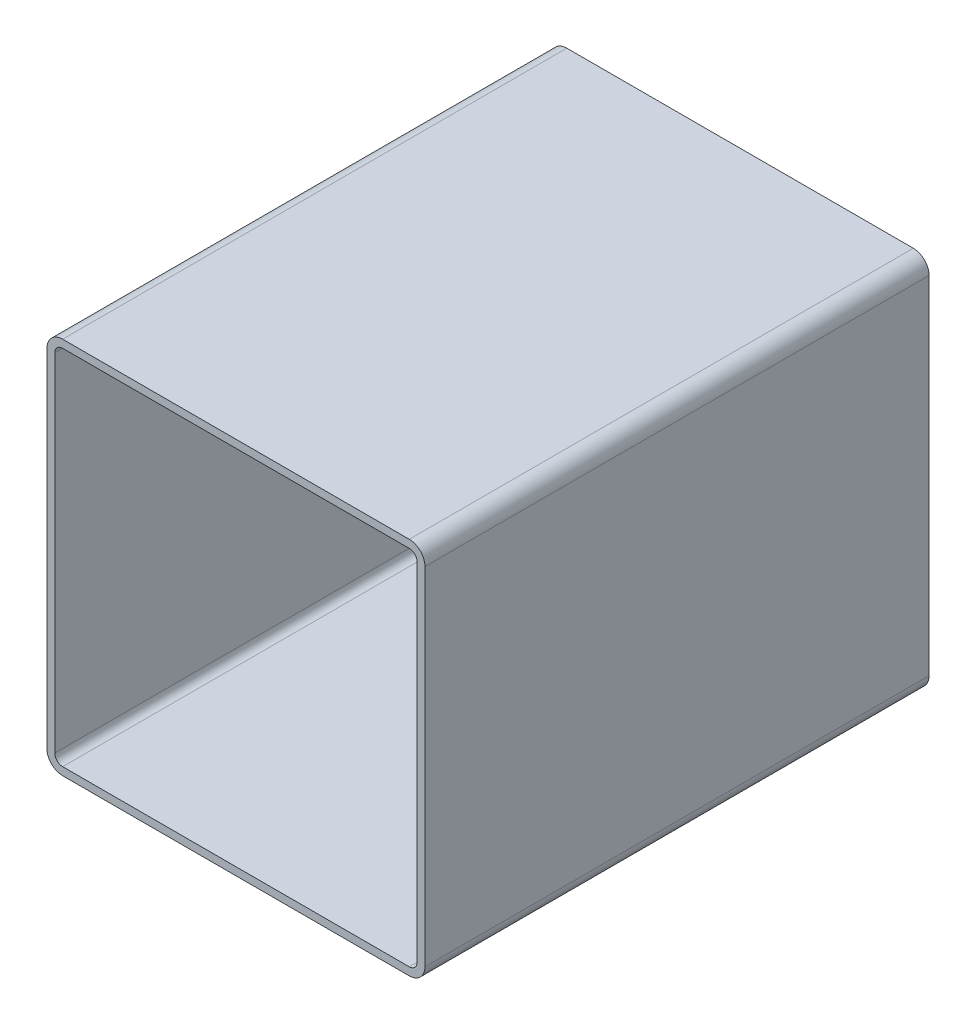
ISO-10303-21;
HEADER;
FILE_DESCRIPTION(('STEP AP214'),'2;1');
FILE_NAME('part.step','',(''),(''),'','','');
FILE_SCHEMA(('AUTOMOTIVE_DESIGN { 1 0 10303 214 1 1 1 1 }'));
ENDSEC;
DATA;
#1=APPLICATION_CONTEXT('core data for automotive mechanical design processes');
#2=APPLICATION_PROTOCOL_DEFINITION('international standard','automotive_design',2000,#1);
#3=PRODUCT_CONTEXT('',#1,'mechanical');
#4=PRODUCT('Part','Part','',(#3));
#5=PRODUCT_RELATED_PRODUCT_CATEGORY('part','',(#4));
#6=PRODUCT_DEFINITION_FORMATION('','',#4);
#7=PRODUCT_DEFINITION_CONTEXT('part definition',#1,'design');
#8=PRODUCT_DEFINITION('design','',#6,#7);
#9=PRODUCT_DEFINITION_SHAPE('','',#8);
#10=(LENGTH_UNIT() NAMED_UNIT(*) SI_UNIT(.MILLI.,.METRE.));
#11=(NAMED_UNIT(*) PLANE_ANGLE_UNIT() SI_UNIT($,.RADIAN.));
#12=(NAMED_UNIT(*) SI_UNIT($,.STERADIAN.) SOLID_ANGLE_UNIT());
#13=UNCERTAINTY_MEASURE_WITH_UNIT(LENGTH_MEASURE(1.E-05),#10,'distance_accuracy_value','');
#14=(GEOMETRIC_REPRESENTATION_CONTEXT(3) GLOBAL_UNCERTAINTY_ASSIGNED_CONTEXT((#13)) GLOBAL_UNIT_ASSIGNED_CONTEXT((#10,
#11,#12)) REPRESENTATION_CONTEXT('',''));
#15=CARTESIAN_POINT('',(0.,0.,0.));
#16=DIRECTION('',(0.,0.,1.));
#17=DIRECTION('',(1.,0.,0.));
#18=AXIS2_PLACEMENT_3D('',#15,#16,#17);
#19=CARTESIAN_POINT('',(219.652002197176,11.4682223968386,304.8));
#20=DIRECTION('',(0.,0.,1.));
#21=DIRECTION('',(1.,0.,0.));
#22=AXIS2_PLACEMENT_3D('',#19,#20,#21);
#23=PLANE('',#22);
#24=CARTESIAN_POINT('',(219.652002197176,11.4682223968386,304.8));
#25=DIRECTION('',(0.,0.,1.));
#26=DIRECTION('',(1.,0.,0.));
#27=AXIS2_PLACEMENT_3D('',#24,#25,#26);
#28=CIRCLE('',#27,9.52500000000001);
#29=CARTESIAN_POINT('',(219.652002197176,1.94322239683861,304.8));
#30=VERTEX_POINT('',#29);
#31=CARTESIAN_POINT('',(229.177002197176,11.4682223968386,304.8));
#32=VERTEX_POINT('',#31);
#33=EDGE_CURVE('E211',#30,#32,#28,.T.);
#34=ORIENTED_EDGE('',*,*,#33,.T.);
#35=DIRECTION('',(0.,1.,0.));
#36=VECTOR('',#35,1.);
#37=CARTESIAN_POINT('',(229.177002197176,221.018222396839,304.8));
#38=LINE('',#37,#36);
#39=CARTESIAN_POINT('',(229.177002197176,221.018222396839,304.8));
#40=VERTEX_POINT('',#39);
#41=EDGE_CURVE('E214',#32,#40,#38,.T.);
#42=ORIENTED_EDGE('',*,*,#41,.T.);
#43=CARTESIAN_POINT('',(219.652002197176,221.018222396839,304.8));
#44=DIRECTION('',(0.,0.,1.));
#45=DIRECTION('',(1.,0.,0.));
#46=AXIS2_PLACEMENT_3D('',#43,#44,#45);
#47=CIRCLE('',#46,9.52500000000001);
#48=CARTESIAN_POINT('',(219.652002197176,230.543222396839,304.8));
#49=VERTEX_POINT('',#48);
#50=EDGE_CURVE('E217',#40,#49,#47,.T.);
#51=ORIENTED_EDGE('',*,*,#50,.T.);
#52=DIRECTION('',(-1.,0.,0.));
#53=VECTOR('',#52,1.);
#54=CARTESIAN_POINT('',(10.1020021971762,230.543222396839,304.8));
#55=LINE('',#54,#53);
#56=CARTESIAN_POINT('',(10.1020021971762,230.543222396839,304.8));
#57=VERTEX_POINT('',#56);
#58=EDGE_CURVE('E219',#49,#57,#55,.T.);
#59=ORIENTED_EDGE('',*,*,#58,.T.);
#60=CARTESIAN_POINT('',(10.1020021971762,221.018222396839,304.8));
#61=DIRECTION('',(0.,0.,1.));
#62=DIRECTION('',(1.,0.,0.));
#63=AXIS2_PLACEMENT_3D('',#60,#61,#62);
#64=CIRCLE('',#63,9.52500000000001);
#65=CARTESIAN_POINT('',(0.577002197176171,221.018222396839,304.8));
#66=VERTEX_POINT('',#65);
#67=EDGE_CURVE('E221',#57,#66,#64,.T.);
#68=ORIENTED_EDGE('',*,*,#67,.T.);
#69=DIRECTION('',(0.,-1.,0.));
#70=VECTOR('',#69,1.);
#71=CARTESIAN_POINT('',(0.577002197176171,11.4682223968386,304.8));
#72=LINE('',#71,#70);
#73=CARTESIAN_POINT('',(0.577002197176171,11.4682223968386,304.8));
#74=VERTEX_POINT('',#73);
#75=EDGE_CURVE('E223',#66,#74,#72,.T.);
#76=ORIENTED_EDGE('',*,*,#75,.T.);
#77=CARTESIAN_POINT('',(10.1020021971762,11.4682223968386,304.8));
#78=DIRECTION('',(0.,0.,1.));
#79=DIRECTION('',(1.,0.,0.));
#80=AXIS2_PLACEMENT_3D('',#77,#78,#79);
#81=CIRCLE('',#80,9.525);
#82=CARTESIAN_POINT('',(10.1020021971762,1.94322239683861,304.8));
#83=VERTEX_POINT('',#82);
#84=EDGE_CURVE('E225',#74,#83,#81,.T.);
#85=ORIENTED_EDGE('',*,*,#84,.T.);
#86=DIRECTION('',(1.,0.,0.));
#87=VECTOR('',#86,1.);
#88=CARTESIAN_POINT('',(219.652002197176,1.94322239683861,304.8));
#89=LINE('',#88,#87);
#90=EDGE_CURVE('E227',#83,#30,#89,.T.);
#91=ORIENTED_EDGE('',*,*,#90,.T.);
#92=EDGE_LOOP('',(#34,#42,#51,#59,#68,#76,#85,#91));
#93=FACE_BOUND('',#92,.T.);
#94=DIRECTION('',(0.,-1.,0.));
#95=VECTOR('',#94,1.);
#96=CARTESIAN_POINT('',(5.33950219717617,11.4682223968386,304.8));
#97=LINE('',#96,#95);
#98=CARTESIAN_POINT('',(5.33950219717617,221.018222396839,304.8));
#99=VERTEX_POINT('',#98);
#100=CARTESIAN_POINT('',(5.33950219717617,11.4682223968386,304.8));
#101=VERTEX_POINT('',#100);
#102=EDGE_CURVE('E154',#99,#101,#97,.T.);
#103=ORIENTED_EDGE('',*,*,#102,.F.);
#104=CARTESIAN_POINT('',(10.1020021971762,221.018222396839,304.8));
#105=DIRECTION('',(0.,0.,1.));
#106=DIRECTION('',(1.,0.,0.));
#107=AXIS2_PLACEMENT_3D('',#104,#105,#106);
#108=CIRCLE('',#107,4.7625);
#109=CARTESIAN_POINT('',(10.1020021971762,225.780722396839,304.8));
#110=VERTEX_POINT('',#109);
#111=EDGE_CURVE('E146',#110,#99,#108,.T.);
#112=ORIENTED_EDGE('',*,*,#111,.F.);
#113=DIRECTION('',(-1.,0.,0.));
#114=VECTOR('',#113,1.);
#115=CARTESIAN_POINT('',(10.1020021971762,225.780722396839,304.8));
#116=LINE('',#115,#114);
#117=CARTESIAN_POINT('',(219.652002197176,225.780722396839,304.8));
#118=VERTEX_POINT('',#117);
#119=EDGE_CURVE('E179',#118,#110,#116,.T.);
#120=ORIENTED_EDGE('',*,*,#119,.F.);
#121=CARTESIAN_POINT('',(219.652002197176,221.018222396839,304.8));
#122=DIRECTION('',(0.,0.,1.));
#123=DIRECTION('',(1.,0.,0.));
#124=AXIS2_PLACEMENT_3D('',#121,#122,#123);
#125=CIRCLE('',#124,4.7625);
#126=CARTESIAN_POINT('',(224.414502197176,221.018222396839,304.8));
#127=VERTEX_POINT('',#126);
#128=EDGE_CURVE('E177',#127,#118,#125,.T.);
#129=ORIENTED_EDGE('',*,*,#128,.F.);
#130=DIRECTION('',(0.,1.,0.));
#131=VECTOR('',#130,1.);
#132=CARTESIAN_POINT('',(224.414502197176,221.018222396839,304.8));
#133=LINE('',#132,#131);
#134=CARTESIAN_POINT('',(224.414502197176,11.4682223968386,304.8));
#135=VERTEX_POINT('',#134);
#136=EDGE_CURVE('E175',#135,#127,#133,.T.);
#137=ORIENTED_EDGE('',*,*,#136,.F.);
#138=CARTESIAN_POINT('',(219.652002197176,11.4682223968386,304.8));
#139=DIRECTION('',(0.,0.,1.));
#140=DIRECTION('',(1.,0.,0.));
#141=AXIS2_PLACEMENT_3D('',#138,#139,#140);
#142=CIRCLE('',#141,4.7625);
#143=CARTESIAN_POINT('',(219.652002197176,6.70572239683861,304.8));
#144=VERTEX_POINT('',#143);
#145=EDGE_CURVE('E173',#144,#135,#142,.T.);
#146=ORIENTED_EDGE('',*,*,#145,.F.);
#147=DIRECTION('',(1.,0.,0.));
#148=VECTOR('',#147,1.);
#149=CARTESIAN_POINT('',(219.652002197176,6.70572239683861,304.8));
#150=LINE('',#149,#148);
#151=CARTESIAN_POINT('',(10.1020021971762,6.70572239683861,304.8));
#152=VERTEX_POINT('',#151);
#153=EDGE_CURVE('E169',#152,#144,#150,.T.);
#154=ORIENTED_EDGE('',*,*,#153,.F.);
#155=CARTESIAN_POINT('',(10.1020021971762,11.4682223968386,304.8));
#156=DIRECTION('',(0.,0.,1.));
#157=DIRECTION('',(1.,0.,0.));
#158=AXIS2_PLACEMENT_3D('',#155,#156,#157);
#159=CIRCLE('',#158,4.7625);
#160=EDGE_CURVE('E167',#101,#152,#159,.T.);
#161=ORIENTED_EDGE('',*,*,#160,.F.);
#162=EDGE_LOOP('',(#103,#112,#120,#129,#137,#146,#154,#161));
#163=FACE_BOUND('',#162,.T.);
#164=ADVANCED_FACE('F33',(#93,#163),#23,.T.);
#165=CARTESIAN_POINT('',(219.652002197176,11.4682223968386,0.));
#166=DIRECTION('',(0.,0.,1.));
#167=DIRECTION('',(1.,0.,0.));
#168=AXIS2_PLACEMENT_3D('',#165,#166,#167);
#169=PLANE('',#168);
#170=CARTESIAN_POINT('',(219.652002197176,11.4682223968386,0.));
#171=DIRECTION('',(0.,0.,1.));
#172=DIRECTION('',(1.,0.,0.));
#173=AXIS2_PLACEMENT_3D('',#170,#171,#172);
#174=CIRCLE('',#173,9.52500000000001);
#175=CARTESIAN_POINT('',(219.652002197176,1.94322239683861,0.));
#176=VERTEX_POINT('',#175);
#177=CARTESIAN_POINT('',(229.177002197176,11.4682223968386,0.));
#178=VERTEX_POINT('',#177);
#179=EDGE_CURVE('E162',#176,#178,#174,.T.);
#180=ORIENTED_EDGE('',*,*,#179,.F.);
#181=DIRECTION('',(1.,0.,0.));
#182=VECTOR('',#181,1.);
#183=CARTESIAN_POINT('',(219.652002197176,1.94322239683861,0.));
#184=LINE('',#183,#182);
#185=CARTESIAN_POINT('',(10.1020021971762,1.94322239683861,0.));
#186=VERTEX_POINT('',#185);
#187=EDGE_CURVE('E215',#186,#176,#184,.T.);
#188=ORIENTED_EDGE('',*,*,#187,.F.);
#189=CARTESIAN_POINT('',(10.1020021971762,11.4682223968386,0.));
#190=DIRECTION('',(0.,0.,1.));
#191=DIRECTION('',(1.,0.,0.));
#192=AXIS2_PLACEMENT_3D('',#189,#190,#191);
#193=CIRCLE('',#192,9.525);
#194=CARTESIAN_POINT('',(0.577002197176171,11.4682223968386,0.));
#195=VERTEX_POINT('',#194);
#196=EDGE_CURVE('E242',#195,#186,#193,.T.);
#197=ORIENTED_EDGE('',*,*,#196,.F.);
#198=DIRECTION('',(0.,-1.,0.));
#199=VECTOR('',#198,1.);
#200=CARTESIAN_POINT('',(0.577002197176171,11.4682223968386,0.));
#201=LINE('',#200,#199);
#202=CARTESIAN_POINT('',(0.577002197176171,221.018222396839,0.));
#203=VERTEX_POINT('',#202);
#204=EDGE_CURVE('E240',#203,#195,#201,.T.);
#205=ORIENTED_EDGE('',*,*,#204,.F.);
#206=CARTESIAN_POINT('',(10.1020021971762,221.018222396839,0.));
#207=DIRECTION('',(0.,0.,1.));
#208=DIRECTION('',(1.,0.,0.));
#209=AXIS2_PLACEMENT_3D('',#206,#207,#208);
#210=CIRCLE('',#209,9.52500000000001);
#211=CARTESIAN_POINT('',(10.1020021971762,230.543222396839,0.));
#212=VERTEX_POINT('',#211);
#213=EDGE_CURVE('E238',#212,#203,#210,.T.);
#214=ORIENTED_EDGE('',*,*,#213,.F.);
#215=DIRECTION('',(-1.,0.,0.));
#216=VECTOR('',#215,1.);
#217=CARTESIAN_POINT('',(10.1020021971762,230.543222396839,0.));
#218=LINE('',#217,#216);
#219=CARTESIAN_POINT('',(219.652002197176,230.543222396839,0.));
#220=VERTEX_POINT('',#219);
#221=EDGE_CURVE('E236',#220,#212,#218,.T.);
#222=ORIENTED_EDGE('',*,*,#221,.F.);
#223=CARTESIAN_POINT('',(219.652002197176,221.018222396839,0.));
#224=DIRECTION('',(0.,0.,1.));
#225=DIRECTION('',(1.,0.,0.));
#226=AXIS2_PLACEMENT_3D('',#223,#224,#225);
#227=CIRCLE('',#226,9.52500000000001);
#228=CARTESIAN_POINT('',(229.177002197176,221.018222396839,0.));
#229=VERTEX_POINT('',#228);
#230=EDGE_CURVE('E234',#229,#220,#227,.T.);
#231=ORIENTED_EDGE('',*,*,#230,.F.);
#232=DIRECTION('',(0.,1.,0.));
#233=VECTOR('',#232,1.);
#234=CARTESIAN_POINT('',(229.177002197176,221.018222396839,0.));
#235=LINE('',#234,#233);
#236=EDGE_CURVE('E232',#178,#229,#235,.T.);
#237=ORIENTED_EDGE('',*,*,#236,.F.);
#238=EDGE_LOOP('',(#180,#188,#197,#205,#214,#222,#231,#237));
#239=FACE_BOUND('',#238,.T.);
#240=CARTESIAN_POINT('',(10.1020021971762,221.018222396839,0.));
#241=DIRECTION('',(0.,0.,1.));
#242=DIRECTION('',(1.,0.,0.));
#243=AXIS2_PLACEMENT_3D('',#240,#241,#242);
#244=CIRCLE('',#243,4.7625);
#245=CARTESIAN_POINT('',(10.1020021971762,225.780722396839,0.));
#246=VERTEX_POINT('',#245);
#247=CARTESIAN_POINT('',(5.33950219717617,221.018222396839,0.));
#248=VERTEX_POINT('',#247);
#249=EDGE_CURVE('E56',#246,#248,#244,.T.);
#250=ORIENTED_EDGE('',*,*,#249,.T.);
#251=DIRECTION('',(0.,-1.,0.));
#252=VECTOR('',#251,1.);
#253=CARTESIAN_POINT('',(5.33950219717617,11.4682223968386,0.));
#254=LINE('',#253,#252);
#255=CARTESIAN_POINT('',(5.33950219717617,11.4682223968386,0.));
#256=VERTEX_POINT('',#255);
#257=EDGE_CURVE('E161',#248,#256,#254,.T.);
#258=ORIENTED_EDGE('',*,*,#257,.T.);
#259=CARTESIAN_POINT('',(10.1020021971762,11.4682223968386,0.));
#260=DIRECTION('',(0.,0.,1.));
#261=DIRECTION('',(1.,0.,0.));
#262=AXIS2_PLACEMENT_3D('',#259,#260,#261);
#263=CIRCLE('',#262,4.7625);
#264=CARTESIAN_POINT('',(10.1020021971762,6.70572239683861,0.));
#265=VERTEX_POINT('',#264);
#266=EDGE_CURVE('E183',#256,#265,#263,.T.);
#267=ORIENTED_EDGE('',*,*,#266,.T.);
#268=DIRECTION('',(1.,0.,0.));
#269=VECTOR('',#268,1.);
#270=CARTESIAN_POINT('',(219.652002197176,6.70572239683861,0.));
#271=LINE('',#270,#269);
#272=CARTESIAN_POINT('',(219.652002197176,6.70572239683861,0.));
#273=VERTEX_POINT('',#272);
#274=EDGE_CURVE('E186',#265,#273,#271,.T.);
#275=ORIENTED_EDGE('',*,*,#274,.T.);
#276=CARTESIAN_POINT('',(219.652002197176,11.4682223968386,0.));
#277=DIRECTION('',(0.,0.,1.));
#278=DIRECTION('',(1.,0.,0.));
#279=AXIS2_PLACEMENT_3D('',#276,#277,#278);
#280=CIRCLE('',#279,4.7625);
#281=CARTESIAN_POINT('',(224.414502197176,11.4682223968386,0.));
#282=VERTEX_POINT('',#281);
#283=EDGE_CURVE('E189',#273,#282,#280,.T.);
#284=ORIENTED_EDGE('',*,*,#283,.T.);
#285=DIRECTION('',(0.,1.,0.));
#286=VECTOR('',#285,1.);
#287=CARTESIAN_POINT('',(224.414502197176,221.018222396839,0.));
#288=LINE('',#287,#286);
#289=CARTESIAN_POINT('',(224.414502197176,221.018222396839,0.));
#290=VERTEX_POINT('',#289);
#291=EDGE_CURVE('E192',#282,#290,#288,.T.);
#292=ORIENTED_EDGE('',*,*,#291,.T.);
#293=CARTESIAN_POINT('',(219.652002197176,221.018222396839,0.));
#294=DIRECTION('',(0.,0.,1.));
#295=DIRECTION('',(1.,0.,0.));
#296=AXIS2_PLACEMENT_3D('',#293,#294,#295);
#297=CIRCLE('',#296,4.7625);
#298=CARTESIAN_POINT('',(219.652002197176,225.780722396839,0.));
#299=VERTEX_POINT('',#298);
#300=EDGE_CURVE('E195',#290,#299,#297,.T.);
#301=ORIENTED_EDGE('',*,*,#300,.T.);
#302=DIRECTION('',(-1.,0.,0.));
#303=VECTOR('',#302,1.);
#304=CARTESIAN_POINT('',(10.1020021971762,225.780722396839,0.));
#305=LINE('',#304,#303);
#306=EDGE_CURVE('E155',#299,#246,#305,.T.);
#307=ORIENTED_EDGE('',*,*,#306,.T.);
#308=EDGE_LOOP('',(#250,#258,#267,#275,#284,#292,#301,#307));
#309=FACE_BOUND('',#308,.T.);
#310=ADVANCED_FACE('F272',(#239,#309),#169,.F.);
#311=CARTESIAN_POINT('',(219.652002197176,11.4682223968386,304.8));
#312=DIRECTION('',(0.,0.,-1.));
#313=DIRECTION('',(-1.,0.,0.));
#314=AXIS2_PLACEMENT_3D('',#311,#312,#313);
#315=CYLINDRICAL_SURFACE('',#314,9.52500000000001);
#316=ORIENTED_EDGE('',*,*,#179,.T.);
#317=DIRECTION('',(0.,0.,-1.));
#318=VECTOR('',#317,1.);
#319=CARTESIAN_POINT('',(229.177002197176,11.4682223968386,304.8));
#320=LINE('',#319,#318);
#321=EDGE_CURVE('E11',#32,#178,#320,.T.);
#322=ORIENTED_EDGE('',*,*,#321,.F.);
#323=ORIENTED_EDGE('',*,*,#33,.F.);
#324=DIRECTION('',(0.,0.,-1.));
#325=VECTOR('',#324,1.);
#326=CARTESIAN_POINT('',(219.652002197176,1.94322239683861,304.8));
#327=LINE('',#326,#325);
#328=EDGE_CURVE('E229',#30,#176,#327,.T.);
#329=ORIENTED_EDGE('',*,*,#328,.T.);
#330=EDGE_LOOP('',(#316,#322,#323,#329));
#331=FACE_BOUND('',#330,.T.);
#332=ADVANCED_FACE('F35',(#331),#315,.T.);
#333=CARTESIAN_POINT('',(229.177002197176,221.018222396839,304.8));
#334=DIRECTION('',(-1.,0.,0.));
#335=DIRECTION('',(0.,0.,1.));
#336=AXIS2_PLACEMENT_3D('',#333,#334,#335);
#337=PLANE('',#336);
#338=ORIENTED_EDGE('',*,*,#236,.T.);
#339=DIRECTION('',(0.,0.,-1.));
#340=VECTOR('',#339,1.);
#341=CARTESIAN_POINT('',(229.177002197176,221.018222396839,304.8));
#342=LINE('',#341,#340);
#343=EDGE_CURVE('E41',#40,#229,#342,.T.);
#344=ORIENTED_EDGE('',*,*,#343,.F.);
#345=ORIENTED_EDGE('',*,*,#41,.F.);
#346=ORIENTED_EDGE('',*,*,#321,.T.);
#347=EDGE_LOOP('',(#338,#344,#345,#346));
#348=FACE_BOUND('',#347,.T.);
#349=ADVANCED_FACE('F289',(#348),#337,.F.);
#350=CARTESIAN_POINT('',(219.652002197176,221.018222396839,304.8));
#351=DIRECTION('',(0.,0.,-1.));
#352=DIRECTION('',(-1.,0.,0.));
#353=AXIS2_PLACEMENT_3D('',#350,#351,#352);
#354=CYLINDRICAL_SURFACE('',#353,9.52500000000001);
#355=ORIENTED_EDGE('',*,*,#230,.T.);
#356=DIRECTION('',(0.,0.,-1.));
#357=VECTOR('',#356,1.);
#358=CARTESIAN_POINT('',(219.652002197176,230.543222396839,304.8));
#359=LINE('',#358,#357);
#360=EDGE_CURVE('E259',#49,#220,#359,.T.);
#361=ORIENTED_EDGE('',*,*,#360,.F.);
#362=ORIENTED_EDGE('',*,*,#50,.F.);
#363=ORIENTED_EDGE('',*,*,#343,.T.);
#364=EDGE_LOOP('',(#355,#361,#362,#363));
#365=FACE_BOUND('',#364,.T.);
#366=ADVANCED_FACE('F266',(#365),#354,.T.);
#367=CARTESIAN_POINT('',(10.1020021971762,230.543222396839,304.8));
#368=DIRECTION('',(0.,-1.,0.));
#369=DIRECTION('',(0.,0.,-1.));
#370=AXIS2_PLACEMENT_3D('',#367,#368,#369);
#371=PLANE('',#370);
#372=ORIENTED_EDGE('',*,*,#221,.T.);
#373=DIRECTION('',(0.,0.,-1.));
#374=VECTOR('',#373,1.);
#375=CARTESIAN_POINT('',(10.1020021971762,230.543222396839,304.8));
#376=LINE('',#375,#374);
#377=EDGE_CURVE('E256',#57,#212,#376,.T.);
#378=ORIENTED_EDGE('',*,*,#377,.F.);
#379=ORIENTED_EDGE('',*,*,#58,.F.);
#380=ORIENTED_EDGE('',*,*,#360,.T.);
#381=EDGE_LOOP('',(#372,#378,#379,#380));
#382=FACE_BOUND('',#381,.T.);
#383=ADVANCED_FACE('F278',(#382),#371,.F.);
#384=CARTESIAN_POINT('',(10.1020021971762,221.018222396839,304.8));
#385=DIRECTION('',(0.,0.,-1.));
#386=DIRECTION('',(-1.,0.,0.));
#387=AXIS2_PLACEMENT_3D('',#384,#385,#386);
#388=CYLINDRICAL_SURFACE('',#387,9.52500000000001);
#389=ORIENTED_EDGE('',*,*,#213,.T.);
#390=DIRECTION('',(0.,0.,-1.));
#391=VECTOR('',#390,1.);
#392=CARTESIAN_POINT('',(0.577002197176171,221.018222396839,304.8));
#393=LINE('',#392,#391);
#394=EDGE_CURVE('E253',#66,#203,#393,.T.);
#395=ORIENTED_EDGE('',*,*,#394,.F.);
#396=ORIENTED_EDGE('',*,*,#67,.F.);
#397=ORIENTED_EDGE('',*,*,#377,.T.);
#398=EDGE_LOOP('',(#389,#395,#396,#397));
#399=FACE_BOUND('',#398,.T.);
#400=ADVANCED_FACE('F282',(#399),#388,.T.);
#401=CARTESIAN_POINT('',(0.577002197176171,11.4682223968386,304.8));
#402=DIRECTION('',(1.,0.,0.));
#403=DIRECTION('',(0.,0.,-1.));
#404=AXIS2_PLACEMENT_3D('',#401,#402,#403);
#405=PLANE('',#404);
#406=ORIENTED_EDGE('',*,*,#204,.T.);
#407=DIRECTION('',(0.,0.,-1.));
#408=VECTOR('',#407,1.);
#409=CARTESIAN_POINT('',(0.577002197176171,11.4682223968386,304.8));
#410=LINE('',#409,#408);
#411=EDGE_CURVE('E250',#74,#195,#410,.T.);
#412=ORIENTED_EDGE('',*,*,#411,.F.);
#413=ORIENTED_EDGE('',*,*,#75,.F.);
#414=ORIENTED_EDGE('',*,*,#394,.T.);
#415=EDGE_LOOP('',(#406,#412,#413,#414));
#416=FACE_BOUND('',#415,.T.);
#417=ADVANCED_FACE('F302',(#416),#405,.F.);
#418=CARTESIAN_POINT('',(10.1020021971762,11.4682223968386,304.8));
#419=DIRECTION('',(0.,0.,-1.));
#420=DIRECTION('',(-1.,0.,0.));
#421=AXIS2_PLACEMENT_3D('',#418,#419,#420);
#422=CYLINDRICAL_SURFACE('',#421,9.525);
#423=ORIENTED_EDGE('',*,*,#196,.T.);
#424=DIRECTION('',(0.,0.,-1.));
#425=VECTOR('',#424,1.);
#426=CARTESIAN_POINT('',(10.1020021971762,1.94322239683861,304.8));
#427=LINE('',#426,#425);
#428=EDGE_CURVE('E247',#83,#186,#427,.T.);
#429=ORIENTED_EDGE('',*,*,#428,.F.);
#430=ORIENTED_EDGE('',*,*,#84,.F.);
#431=ORIENTED_EDGE('',*,*,#411,.T.);
#432=EDGE_LOOP('',(#423,#429,#430,#431));
#433=FACE_BOUND('',#432,.T.);
#434=ADVANCED_FACE('F300',(#433),#422,.T.);
#435=CARTESIAN_POINT('',(219.652002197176,1.94322239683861,304.8));
#436=DIRECTION('',(0.,1.,0.));
#437=DIRECTION('',(0.,0.,1.));
#438=AXIS2_PLACEMENT_3D('',#435,#436,#437);
#439=PLANE('',#438);
#440=ORIENTED_EDGE('',*,*,#187,.T.);
#441=ORIENTED_EDGE('',*,*,#328,.F.);
#442=ORIENTED_EDGE('',*,*,#90,.F.);
#443=ORIENTED_EDGE('',*,*,#428,.T.);
#444=EDGE_LOOP('',(#440,#441,#442,#443));
#445=FACE_BOUND('',#444,.T.);
#446=ADVANCED_FACE('F295',(#445),#439,.F.);
#447=CARTESIAN_POINT('',(10.1020021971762,221.018222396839,304.8));
#448=DIRECTION('',(0.,0.,-1.));
#449=DIRECTION('',(-1.,0.,0.));
#450=AXIS2_PLACEMENT_3D('',#447,#448,#449);
#451=CYLINDRICAL_SURFACE('',#450,4.7625);
#452=ORIENTED_EDGE('',*,*,#249,.F.);
#453=DIRECTION('',(0.,0.,-1.));
#454=VECTOR('',#453,1.);
#455=CARTESIAN_POINT('',(10.1020021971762,225.780722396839,304.8));
#456=LINE('',#455,#454);
#457=EDGE_CURVE('E150',#110,#246,#456,.T.);
#458=ORIENTED_EDGE('',*,*,#457,.F.);
#459=ORIENTED_EDGE('',*,*,#111,.T.);
#460=DIRECTION('',(0.,0.,-1.));
#461=VECTOR('',#460,1.);
#462=CARTESIAN_POINT('',(5.33950219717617,221.018222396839,304.8));
#463=LINE('',#462,#461);
#464=EDGE_CURVE('E149',#99,#248,#463,.T.);
#465=ORIENTED_EDGE('',*,*,#464,.T.);
#466=EDGE_LOOP('',(#452,#458,#459,#465));
#467=FACE_BOUND('',#466,.T.);
#468=ADVANCED_FACE('F148',(#467),#451,.F.);
#469=CARTESIAN_POINT('',(5.33950219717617,11.4682223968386,304.8));
#470=DIRECTION('',(1.,0.,0.));
#471=DIRECTION('',(0.,0.,-1.));
#472=AXIS2_PLACEMENT_3D('',#469,#470,#471);
#473=PLANE('',#472);
#474=ORIENTED_EDGE('',*,*,#257,.F.);
#475=ORIENTED_EDGE('',*,*,#464,.F.);
#476=ORIENTED_EDGE('',*,*,#102,.T.);
#477=DIRECTION('',(0.,0.,-1.));
#478=VECTOR('',#477,1.);
#479=CARTESIAN_POINT('',(5.33950219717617,11.4682223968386,304.8));
#480=LINE('',#479,#478);
#481=EDGE_CURVE('E163',#101,#256,#480,.T.);
#482=ORIENTED_EDGE('',*,*,#481,.T.);
#483=EDGE_LOOP('',(#474,#475,#476,#482));
#484=FACE_BOUND('',#483,.T.);
#485=ADVANCED_FACE('F158',(#484),#473,.T.);
#486=CARTESIAN_POINT('',(10.1020021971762,11.4682223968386,304.8));
#487=DIRECTION('',(0.,0.,-1.));
#488=DIRECTION('',(-1.,0.,0.));
#489=AXIS2_PLACEMENT_3D('',#486,#487,#488);
#490=CYLINDRICAL_SURFACE('',#489,4.7625);
#491=ORIENTED_EDGE('',*,*,#266,.F.);
#492=ORIENTED_EDGE('',*,*,#481,.F.);
#493=ORIENTED_EDGE('',*,*,#160,.T.);
#494=DIRECTION('',(0.,0.,-1.));
#495=VECTOR('',#494,1.);
#496=CARTESIAN_POINT('',(10.1020021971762,6.70572239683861,304.8));
#497=LINE('',#496,#495);
#498=EDGE_CURVE('E208',#152,#265,#497,.T.);
#499=ORIENTED_EDGE('',*,*,#498,.T.);
#500=EDGE_LOOP('',(#491,#492,#493,#499));
#501=FACE_BOUND('',#500,.T.);
#502=ADVANCED_FACE('F327',(#501),#490,.F.);
#503=CARTESIAN_POINT('',(219.652002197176,6.70572239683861,304.8));
#504=DIRECTION('',(0.,1.,0.));
#505=DIRECTION('',(0.,0.,1.));
#506=AXIS2_PLACEMENT_3D('',#503,#504,#505);
#507=PLANE('',#506);
#508=ORIENTED_EDGE('',*,*,#274,.F.);
#509=ORIENTED_EDGE('',*,*,#498,.F.);
#510=ORIENTED_EDGE('',*,*,#153,.T.);
#511=DIRECTION('',(0.,0.,-1.));
#512=VECTOR('',#511,1.);
#513=CARTESIAN_POINT('',(219.652002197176,6.70572239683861,304.8));
#514=LINE('',#513,#512);
#515=EDGE_CURVE('E206',#144,#273,#514,.T.);
#516=ORIENTED_EDGE('',*,*,#515,.T.);
#517=EDGE_LOOP('',(#508,#509,#510,#516));
#518=FACE_BOUND('',#517,.T.);
#519=ADVANCED_FACE('F331',(#518),#507,.T.);
#520=CARTESIAN_POINT('',(219.652002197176,11.4682223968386,304.8));
#521=DIRECTION('',(0.,0.,-1.));
#522=DIRECTION('',(-1.,0.,0.));
#523=AXIS2_PLACEMENT_3D('',#520,#521,#522);
#524=CYLINDRICAL_SURFACE('',#523,4.7625);
#525=ORIENTED_EDGE('',*,*,#283,.F.);
#526=ORIENTED_EDGE('',*,*,#515,.F.);
#527=ORIENTED_EDGE('',*,*,#145,.T.);
#528=DIRECTION('',(0.,0.,-1.));
#529=VECTOR('',#528,1.);
#530=CARTESIAN_POINT('',(224.414502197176,11.4682223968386,304.8));
#531=LINE('',#530,#529);
#532=EDGE_CURVE('E204',#135,#282,#531,.T.);
#533=ORIENTED_EDGE('',*,*,#532,.T.);
#534=EDGE_LOOP('',(#525,#526,#527,#533));
#535=FACE_BOUND('',#534,.T.);
#536=ADVANCED_FACE('F337',(#535),#524,.F.);
#537=CARTESIAN_POINT('',(224.414502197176,221.018222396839,304.8));
#538=DIRECTION('',(-1.,0.,0.));
#539=DIRECTION('',(0.,0.,1.));
#540=AXIS2_PLACEMENT_3D('',#537,#538,#539);
#541=PLANE('',#540);
#542=ORIENTED_EDGE('',*,*,#291,.F.);
#543=ORIENTED_EDGE('',*,*,#532,.F.);
#544=ORIENTED_EDGE('',*,*,#136,.T.);
#545=DIRECTION('',(0.,0.,-1.));
#546=VECTOR('',#545,1.);
#547=CARTESIAN_POINT('',(224.414502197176,221.018222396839,304.8));
#548=LINE('',#547,#546);
#549=EDGE_CURVE('E202',#127,#290,#548,.T.);
#550=ORIENTED_EDGE('',*,*,#549,.T.);
#551=EDGE_LOOP('',(#542,#543,#544,#550));
#552=FACE_BOUND('',#551,.T.);
#553=ADVANCED_FACE('F341',(#552),#541,.T.);
#554=CARTESIAN_POINT('',(219.652002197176,221.018222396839,304.8));
#555=DIRECTION('',(0.,0.,-1.));
#556=DIRECTION('',(-1.,0.,0.));
#557=AXIS2_PLACEMENT_3D('',#554,#555,#556);
#558=CYLINDRICAL_SURFACE('',#557,4.7625);
#559=ORIENTED_EDGE('',*,*,#300,.F.);
#560=ORIENTED_EDGE('',*,*,#549,.F.);
#561=ORIENTED_EDGE('',*,*,#128,.T.);
#562=DIRECTION('',(0.,0.,-1.));
#563=VECTOR('',#562,1.);
#564=CARTESIAN_POINT('',(219.652002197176,225.780722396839,304.8));
#565=LINE('',#564,#563);
#566=EDGE_CURVE('E48',#118,#299,#565,.T.);
#567=ORIENTED_EDGE('',*,*,#566,.T.);
#568=EDGE_LOOP('',(#559,#560,#561,#567));
#569=FACE_BOUND('',#568,.T.);
#570=ADVANCED_FACE('F345',(#569),#558,.F.);
#571=CARTESIAN_POINT('',(10.1020021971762,225.780722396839,304.8));
#572=DIRECTION('',(0.,-1.,0.));
#573=DIRECTION('',(0.,0.,-1.));
#574=AXIS2_PLACEMENT_3D('',#571,#572,#573);
#575=PLANE('',#574);
#576=ORIENTED_EDGE('',*,*,#306,.F.);
#577=ORIENTED_EDGE('',*,*,#566,.F.);
#578=ORIENTED_EDGE('',*,*,#119,.T.);
#579=ORIENTED_EDGE('',*,*,#457,.T.);
#580=EDGE_LOOP('',(#576,#577,#578,#579));
#581=FACE_BOUND('',#580,.T.);
#582=ADVANCED_FACE('F349',(#581),#575,.T.);
#583=CLOSED_SHELL('',(#164,#310,#332,#349,#366,#383,#400,#417,#434,#446,#468,#485,#502,#519,
#536,#553,#570,#582));
#584=MANIFOLD_SOLID_BREP('B2',#583);
#585=ADVANCED_BREP_SHAPE_REPRESENTATION('',(#18,#584),#14);
#586=SHAPE_DEFINITION_REPRESENTATION(#9,#585);
ENDSEC;
END-ISO-10303-21;
